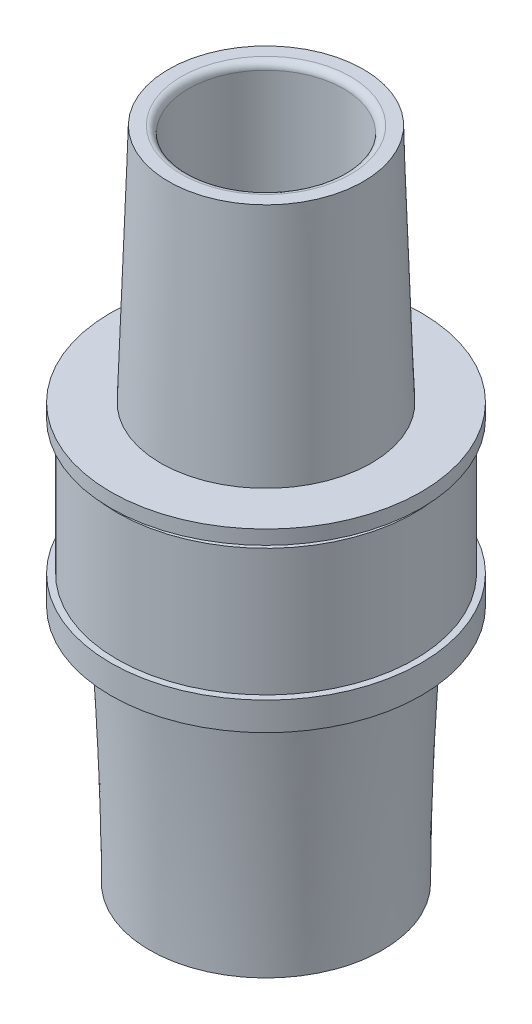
ISO-10303-21;
HEADER;
FILE_DESCRIPTION(('STEP AP214'),'2;1');
FILE_NAME('part.step','',(''),(''),'','','');
FILE_SCHEMA(('AUTOMOTIVE_DESIGN { 1 0 10303 214 1 1 1 1 }'));
ENDSEC;
DATA;
#1=APPLICATION_CONTEXT('core data for automotive mechanical design processes');
#2=APPLICATION_PROTOCOL_DEFINITION('international standard','automotive_design',2000,#1);
#3=PRODUCT_CONTEXT('',#1,'mechanical');
#4=PRODUCT('Part','Part','',(#3));
#5=PRODUCT_RELATED_PRODUCT_CATEGORY('part','',(#4));
#6=PRODUCT_DEFINITION_FORMATION('','',#4);
#7=PRODUCT_DEFINITION_CONTEXT('part definition',#1,'design');
#8=PRODUCT_DEFINITION('design','',#6,#7);
#9=PRODUCT_DEFINITION_SHAPE('','',#8);
#10=(LENGTH_UNIT() NAMED_UNIT(*) SI_UNIT(.MILLI.,.METRE.));
#11=(NAMED_UNIT(*) PLANE_ANGLE_UNIT() SI_UNIT($,.RADIAN.));
#12=(NAMED_UNIT(*) SI_UNIT($,.STERADIAN.) SOLID_ANGLE_UNIT());
#13=UNCERTAINTY_MEASURE_WITH_UNIT(LENGTH_MEASURE(1.E-05),#10,'distance_accuracy_value','');
#14=(GEOMETRIC_REPRESENTATION_CONTEXT(3) GLOBAL_UNCERTAINTY_ASSIGNED_CONTEXT((#13)) GLOBAL_UNIT_ASSIGNED_CONTEXT((#10,
#11,#12)) REPRESENTATION_CONTEXT('',''));
#15=CARTESIAN_POINT('',(0.,0.,0.));
#16=DIRECTION('',(0.,0.,1.));
#17=DIRECTION('',(1.,0.,0.));
#18=AXIS2_PLACEMENT_3D('',#15,#16,#17);
#19=CARTESIAN_POINT('',(0.,-37.,0.));
#20=DIRECTION('',(0.,1.,0.));
#21=DIRECTION('',(0.,0.,1.));
#22=AXIS2_PLACEMENT_3D('',#19,#20,#21);
#23=PLANE('',#22);
#24=CARTESIAN_POINT('',(0.,-37.,0.));
#25=DIRECTION('',(0.,1.,0.));
#26=DIRECTION('',(0.,0.,1.));
#27=AXIS2_PLACEMENT_3D('',#24,#25,#26);
#28=CIRCLE('',#27,8.25);
#29=CARTESIAN_POINT('',(-8.23983871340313,-37.,0.409338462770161));
#30=VERTEX_POINT('',#29);
#31=EDGE_CURVE('E65',#30,#30,#28,.T.);
#32=ORIENTED_EDGE('',*,*,#31,.F.);
#33=EDGE_LOOP('',(#32));
#34=FACE_BOUND('',#33,.T.);
#35=DIRECTION('',(0.382683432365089,0.,0.923879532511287));
#36=VECTOR('',#35,1.);
#37=CARTESIAN_POINT('',(-3.75029763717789,-37.,3.75029763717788));
#38=LINE('',#37,#36);
#39=CARTESIAN_POINT('',(-5.30372178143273,-37.,0.));
#40=VERTEX_POINT('',#39);
#41=CARTESIAN_POINT('',(-3.75029763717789,-37.,3.75029763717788));
#42=VERTEX_POINT('',#41);
#43=EDGE_CURVE('E139',#40,#42,#38,.T.);
#44=ORIENTED_EDGE('',*,*,#43,.T.);
#45=DIRECTION('',(0.923879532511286,0.,0.382683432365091));
#46=VECTOR('',#45,1.);
#47=CARTESIAN_POINT('',(0.,-37.,5.30372178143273));
#48=LINE('',#47,#46);
#49=CARTESIAN_POINT('',(0.,-37.,5.30372178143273));
#50=VERTEX_POINT('',#49);
#51=EDGE_CURVE('E146',#42,#50,#48,.T.);
#52=ORIENTED_EDGE('',*,*,#51,.T.);
#53=DIRECTION('',(0.923879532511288,0.,-0.382683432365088));
#54=VECTOR('',#53,1.);
#55=CARTESIAN_POINT('',(3.75029763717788,-37.,3.75029763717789));
#56=LINE('',#55,#54);
#57=CARTESIAN_POINT('',(3.75029763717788,-37.,3.75029763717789));
#58=VERTEX_POINT('',#57);
#59=EDGE_CURVE('E148',#50,#58,#56,.T.);
#60=ORIENTED_EDGE('',*,*,#59,.T.);
#61=DIRECTION('',(0.382683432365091,0.,-0.923879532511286));
#62=VECTOR('',#61,1.);
#63=CARTESIAN_POINT('',(5.30372178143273,-37.,0.));
#64=LINE('',#63,#62);
#65=CARTESIAN_POINT('',(5.30372178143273,-37.,0.));
#66=VERTEX_POINT('',#65);
#67=EDGE_CURVE('E157',#58,#66,#64,.T.);
#68=ORIENTED_EDGE('',*,*,#67,.T.);
#69=DIRECTION('',(-0.382683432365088,0.,-0.923879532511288));
#70=VECTOR('',#69,1.);
#71=CARTESIAN_POINT('',(3.75029763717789,-37.,-3.75029763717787));
#72=LINE('',#71,#70);
#73=CARTESIAN_POINT('',(3.75029763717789,-37.,-3.75029763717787));
#74=VERTEX_POINT('',#73);
#75=EDGE_CURVE('E154',#66,#74,#72,.T.);
#76=ORIENTED_EDGE('',*,*,#75,.T.);
#77=DIRECTION('',(-0.923879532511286,0.,-0.382683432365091));
#78=VECTOR('',#77,1.);
#79=CARTESIAN_POINT('',(0.,-37.,-5.30372178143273));
#80=LINE('',#79,#78);
#81=CARTESIAN_POINT('',(0.,-37.,-5.30372178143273));
#82=VERTEX_POINT('',#81);
#83=EDGE_CURVE('E152',#74,#82,#80,.T.);
#84=ORIENTED_EDGE('',*,*,#83,.T.);
#85=DIRECTION('',(-0.923879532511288,0.,0.382683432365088));
#86=VECTOR('',#85,1.);
#87=CARTESIAN_POINT('',(-3.75029763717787,-37.,-3.75029763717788));
#88=LINE('',#87,#86);
#89=CARTESIAN_POINT('',(-3.75029763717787,-37.,-3.75029763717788));
#90=VERTEX_POINT('',#89);
#91=EDGE_CURVE('E142',#82,#90,#88,.T.);
#92=ORIENTED_EDGE('',*,*,#91,.T.);
#93=DIRECTION('',(-0.382683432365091,0.,0.923879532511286));
#94=VECTOR('',#93,1.);
#95=CARTESIAN_POINT('',(-5.30372178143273,-37.,0.));
#96=LINE('',#95,#94);
#97=EDGE_CURVE('E126',#90,#40,#96,.T.);
#98=ORIENTED_EDGE('',*,*,#97,.T.);
#99=EDGE_LOOP('',(#44,#52,#60,#68,#76,#84,#92,#98));
#100=FACE_BOUND('',#99,.T.);
#101=ADVANCED_FACE('F54',(#34,#100),#23,.F.);
#102=CARTESIAN_POINT('',(-8.23983871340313,-37.,0.409338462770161));
#103=CARTESIAN_POINT('',(-8.17687382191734,-20.,3.51407662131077));
#104=CARTESIAN_POINT('',(-7.42116178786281,-37.,16.8890158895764));
#105=CARTESIAN_POINT('',(-1.1487205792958,-20.,19.8678242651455));
#106=CARTESIAN_POINT('',(9.05851563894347,-37.,16.0703389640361));
#107=CARTESIAN_POINT('',(15.2050270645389,-20.,12.8396710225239));
#108=CARTESIAN_POINT('',(8.23983871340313,-37.,-0.40933846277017));
#109=CARTESIAN_POINT('',(8.17687382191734,-20.,-3.51407662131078));
#110=CARTESIAN_POINT('',(7.42116178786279,-37.,-16.8890158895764));
#111=CARTESIAN_POINT('',(1.14872057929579,-20.,-19.8678242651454));
#112=CARTESIAN_POINT('',(-9.05851563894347,-37.,-16.0703389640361));
#113=CARTESIAN_POINT('',(-15.2050270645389,-20.,-12.8396710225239));
#114=CARTESIAN_POINT('',(-8.23983871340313,-37.,0.409338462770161));
#115=CARTESIAN_POINT('',(-8.17687382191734,-20.,3.51407662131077));
#116=(BOUNDED_SURFACE() B_SPLINE_SURFACE(3,1,((#102,#103),(#104,#105),(#106,#107),(#108,#109),
(#110,#111),(#112,#113),(#114,#115)),.UNSPECIFIED.,.T.,.F.,.F.) B_SPLINE_SURFACE_WITH_KNOTS((4,
3,4),(2,2),(0.,0.5,1.),(0.,1.),
.UNSPECIFIED.) GEOMETRIC_REPRESENTATION_ITEM() RATIONAL_B_SPLINE_SURFACE(((1.,1.),
(0.333333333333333,0.333333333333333),(0.333333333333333,0.333333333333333),(1.,1.),
(0.333333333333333,0.333333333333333),(0.333333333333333,0.333333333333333),(1.,1.))) REPRESENTATION_ITEM('') SURFACE());
#117=CARTESIAN_POINT('',(0.,-20.,0.));
#118=DIRECTION('',(0.,1.,0.));
#119=DIRECTION('',(0.,0.,1.));
#120=AXIS2_PLACEMENT_3D('',#117,#118,#119);
#121=CIRCLE('',#120,8.9);
#122=CARTESIAN_POINT('',(-8.17687382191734,-20.,3.51407662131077));
#123=VERTEX_POINT('',#122);
#124=EDGE_CURVE('E14',#123,#123,#121,.T.);
#125=CARTESIAN_POINT('',(-8.23983871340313,-37.,0.409338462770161));
#126=CARTESIAN_POINT('',(-8.23918282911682,-36.8229166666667,0.44167948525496));
#127=CARTESIAN_POINT('',(-8.23852694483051,-36.6458333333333,0.474020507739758));
#128=CARTESIAN_POINT('',(-8.23721517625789,-36.2916666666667,0.538702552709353));
#129=CARTESIAN_POINT('',(-8.23655929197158,-36.1145833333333,0.571043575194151));
#130=CARTESIAN_POINT('',(-8.23524752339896,-35.7604166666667,0.635725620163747));
#131=CARTESIAN_POINT('',(-8.23459163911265,-35.5833333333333,0.668066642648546));
#132=CARTESIAN_POINT('',(-8.23327987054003,-35.2291666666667,0.732748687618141));
#133=CARTESIAN_POINT('',(-8.23262398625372,-35.0520833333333,0.765089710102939));
#134=CARTESIAN_POINT('',(-8.2313122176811,-34.6979166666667,0.829771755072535));
#135=CARTESIAN_POINT('',(-8.23065633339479,-34.5208333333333,0.862112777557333));
#136=CARTESIAN_POINT('',(-8.22934456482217,-34.1666666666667,0.926794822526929));
#137=CARTESIAN_POINT('',(-8.22868868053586,-33.9895833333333,0.959135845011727));
#138=CARTESIAN_POINT('',(-8.22737691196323,-33.6354166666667,1.02381788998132));
#139=CARTESIAN_POINT('',(-8.22672102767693,-33.4583333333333,1.05615891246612));
#140=CARTESIAN_POINT('',(-8.22540925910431,-33.1041666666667,1.12084095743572));
#141=CARTESIAN_POINT('',(-8.224753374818,-32.9270833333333,1.15318197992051));
#142=CARTESIAN_POINT('',(-8.22344160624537,-32.5729166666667,1.21786402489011));
#143=CARTESIAN_POINT('',(-8.22278572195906,-32.3958333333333,1.25020504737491));
#144=CARTESIAN_POINT('',(-8.22147395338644,-32.0416666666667,1.3148870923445));
#145=CARTESIAN_POINT('',(-8.22081806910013,-31.8645833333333,1.3472281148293));
#146=CARTESIAN_POINT('',(-8.21950630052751,-31.5104166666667,1.4119101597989));
#147=CARTESIAN_POINT('',(-8.2188504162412,-31.3333333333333,1.4442511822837));
#148=CARTESIAN_POINT('',(-8.21753864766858,-30.9791666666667,1.50893322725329));
#149=CARTESIAN_POINT('',(-8.21688276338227,-30.8020833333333,1.54127424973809));
#150=CARTESIAN_POINT('',(-8.21557099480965,-30.4479166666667,1.60595629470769));
#151=CARTESIAN_POINT('',(-8.21491511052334,-30.2708333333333,1.63829731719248));
#152=CARTESIAN_POINT('',(-8.21360334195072,-29.9166666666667,1.70297936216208));
#153=CARTESIAN_POINT('',(-8.21294745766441,-29.7395833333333,1.73532038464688));
#154=CARTESIAN_POINT('',(-8.21163568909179,-29.3854166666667,1.80000242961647));
#155=CARTESIAN_POINT('',(-8.21097980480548,-29.2083333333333,1.83234345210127));
#156=CARTESIAN_POINT('',(-8.20966803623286,-28.8541666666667,1.89702549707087));
#157=CARTESIAN_POINT('',(-8.20901215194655,-28.6770833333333,1.92936651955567));
#158=CARTESIAN_POINT('',(-8.20770038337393,-28.3229166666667,1.99404856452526));
#159=CARTESIAN_POINT('',(-8.20704449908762,-28.1458333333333,2.02638958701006));
#160=CARTESIAN_POINT('',(-8.20573273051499,-27.7916666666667,2.09107163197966));
#161=CARTESIAN_POINT('',(-8.20507684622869,-27.6145833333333,2.12341265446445));
#162=CARTESIAN_POINT('',(-8.20376507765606,-27.2604166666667,2.18809469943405));
#163=CARTESIAN_POINT('',(-8.20310919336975,-27.0833333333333,2.22043572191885));
#164=CARTESIAN_POINT('',(-8.20179742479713,-26.7291666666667,2.28511776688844));
#165=CARTESIAN_POINT('',(-8.20114154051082,-26.5520833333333,2.31745878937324));
#166=CARTESIAN_POINT('',(-8.1998297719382,-26.1979166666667,2.38214083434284));
#167=CARTESIAN_POINT('',(-8.19917388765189,-26.0208333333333,2.41448185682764));
#168=CARTESIAN_POINT('',(-8.19786211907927,-25.6666666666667,2.47916390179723));
#169=CARTESIAN_POINT('',(-8.19720623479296,-25.4895833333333,2.51150492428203));
#170=CARTESIAN_POINT('',(-8.19589446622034,-25.1354166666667,2.57618696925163));
#171=CARTESIAN_POINT('',(-8.19523858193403,-24.9583333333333,2.60852799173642));
#172=CARTESIAN_POINT('',(-8.19392681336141,-24.6041666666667,2.67321003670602));
#173=CARTESIAN_POINT('',(-8.1932709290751,-24.4270833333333,2.70555105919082));
#174=CARTESIAN_POINT('',(-8.19195916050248,-24.0729166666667,2.77023310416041));
#175=CARTESIAN_POINT('',(-8.19130327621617,-23.8958333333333,2.80257412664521));
#176=CARTESIAN_POINT('',(-8.18999150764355,-23.5416666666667,2.86725617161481));
#177=CARTESIAN_POINT('',(-8.18933562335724,-23.3645833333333,2.89959719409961));
#178=CARTESIAN_POINT('',(-8.18802385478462,-23.0104166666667,2.9642792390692));
#179=CARTESIAN_POINT('',(-8.18736797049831,-22.8333333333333,2.996620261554));
#180=CARTESIAN_POINT('',(-8.18605620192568,-22.4791666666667,3.0613023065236));
#181=CARTESIAN_POINT('',(-8.18540031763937,-22.3020833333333,3.09364332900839));
#182=CARTESIAN_POINT('',(-8.18408854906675,-21.9479166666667,3.15832537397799));
#183=CARTESIAN_POINT('',(-8.18343266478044,-21.7708333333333,3.19066639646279));
#184=CARTESIAN_POINT('',(-8.18212089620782,-21.4166666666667,3.25534844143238));
#185=CARTESIAN_POINT('',(-8.18146501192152,-21.2395833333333,3.28768946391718));
#186=CARTESIAN_POINT('',(-8.18015324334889,-20.8854166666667,3.35237150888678));
#187=CARTESIAN_POINT('',(-8.17949735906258,-20.7083333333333,3.38471253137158));
#188=CARTESIAN_POINT('',(-8.17818559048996,-20.3541666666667,3.44939457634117));
#189=CARTESIAN_POINT('',(-8.17752970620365,-20.1770833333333,3.48173559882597));
#190=CARTESIAN_POINT('',(-8.17687382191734,-20.,3.51407662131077));
#191=B_SPLINE_CURVE_WITH_KNOTS('',3,(#125,#126,#127,#128,#129,#130,#131,#132,#133,#134,#135,
#136,#137,#138,#139,#140,#141,#142,#143,#144,#145,#146,#147,#148,#149,#150,#151,#152,#153,#154,
#155,#156,#157,#158,#159,#160,#161,#162,#163,#164,#165,#166,#167,#168,#169,#170,#171,#172,#173,
#174,#175,#176,#177,#178,#179,#180,#181,#182,#183,#184,#185,#186,#187,#188,#189,#190),
.UNSPECIFIED.,.F.,.F.,(4,2,2,2,2,2,2,2,2,2,2,2,2,2,2,2,2,2,2,2,2,2,2,2,2,2,2,2,2,2,2,2,4),(0.,
0.54004065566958,1.08008131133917,1.62012196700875,2.16016262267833,2.70020327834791,
3.24024393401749,3.78028458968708,4.32032524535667,4.86036590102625,5.40040655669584,
5.94044721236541,6.480487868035,7.02052852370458,7.56056917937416,8.10060983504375,
8.64065049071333,9.18069114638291,9.7207318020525,10.2607724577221,10.8008131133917,
11.3408537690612,11.8808944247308,12.4209350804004,12.96097573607,13.5010163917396,
14.0410570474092,14.5810977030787,15.1211383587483,15.6611790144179,16.2012196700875,
16.7412603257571,17.2813009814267),.UNSPECIFIED.);
#192=EDGE_CURVE('BSEAM56',#30,#123,#191,.T.);
#193=ORIENTED_EDGE('',*,*,#31,.T.);
#194=ORIENTED_EDGE('',*,*,#124,.F.);
#195=ORIENTED_EDGE('',*,*,#192,.T.);
#196=ORIENTED_EDGE('',*,*,#192,.F.);
#197=EDGE_LOOP('',(#193,#195,#194,#196));
#198=FACE_BOUND('',#197,.T.);
#199=ADVANCED_FACE('F56',(#198),#116,.T.);
#200=CARTESIAN_POINT('',(0.,-19.,-11.));
#201=DIRECTION('',(0.,-1.,0.));
#202=DIRECTION('',(0.,0.,-1.));
#203=AXIS2_PLACEMENT_3D('',#200,#201,#202);
#204=PLANE('',#203);
#205=CARTESIAN_POINT('',(0.,-19.,0.));
#206=DIRECTION('',(0.,1.,0.));
#207=DIRECTION('',(0.,0.,1.));
#208=AXIS2_PLACEMENT_3D('',#205,#206,#207);
#209=CIRCLE('',#208,4.);
#210=CARTESIAN_POINT('',(0.,-19.,4.));
#211=VERTEX_POINT('',#210);
#212=EDGE_CURVE('E213',#211,#211,#209,.T.);
#213=ORIENTED_EDGE('',*,*,#212,.T.);
#214=EDGE_LOOP('',(#213));
#215=FACE_BOUND('',#214,.T.);
#216=DIRECTION('',(-0.923879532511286,0.,-0.382683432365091));
#217=VECTOR('',#216,1.);
#218=CARTESIAN_POINT('',(0.,-19.,5.30372178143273));
#219=LINE('',#218,#217);
#220=CARTESIAN_POINT('',(0.,-19.,5.30372178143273));
#221=VERTEX_POINT('',#220);
#222=CARTESIAN_POINT('',(-3.75029763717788,-19.,3.75029763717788));
#223=VERTEX_POINT('',#222);
#224=EDGE_CURVE('E179',#221,#223,#219,.T.);
#225=ORIENTED_EDGE('',*,*,#224,.T.);
#226=DIRECTION('',(-0.382683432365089,0.,-0.923879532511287));
#227=VECTOR('',#226,1.);
#228=CARTESIAN_POINT('',(-3.75029763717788,-19.,3.75029763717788));
#229=LINE('',#228,#227);
#230=CARTESIAN_POINT('',(-5.30372178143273,-19.,0.));
#231=VERTEX_POINT('',#230);
#232=EDGE_CURVE('E143',#223,#231,#229,.T.);
#233=ORIENTED_EDGE('',*,*,#232,.T.);
#234=DIRECTION('',(0.382683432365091,0.,-0.923879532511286));
#235=VECTOR('',#234,1.);
#236=CARTESIAN_POINT('',(-5.30372178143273,-19.,0.));
#237=LINE('',#236,#235);
#238=CARTESIAN_POINT('',(-3.75029763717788,-19.,-3.75029763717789));
#239=VERTEX_POINT('',#238);
#240=EDGE_CURVE('E128',#231,#239,#237,.T.);
#241=ORIENTED_EDGE('',*,*,#240,.T.);
#242=DIRECTION('',(0.923879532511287,0.,-0.382683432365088));
#243=VECTOR('',#242,1.);
#244=CARTESIAN_POINT('',(-3.75029763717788,-19.,-3.75029763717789));
#245=LINE('',#244,#243);
#246=CARTESIAN_POINT('',(0.,-19.,-5.30372178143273));
#247=VERTEX_POINT('',#246);
#248=EDGE_CURVE('E164',#239,#247,#245,.T.);
#249=ORIENTED_EDGE('',*,*,#248,.T.);
#250=DIRECTION('',(0.923879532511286,0.,0.382683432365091));
#251=VECTOR('',#250,1.);
#252=CARTESIAN_POINT('',(0.,-19.,-5.30372178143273));
#253=LINE('',#252,#251);
#254=CARTESIAN_POINT('',(3.75029763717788,-19.,-3.75029763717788));
#255=VERTEX_POINT('',#254);
#256=EDGE_CURVE('E167',#247,#255,#253,.T.);
#257=ORIENTED_EDGE('',*,*,#256,.T.);
#258=DIRECTION('',(0.382683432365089,0.,0.923879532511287));
#259=VECTOR('',#258,1.);
#260=CARTESIAN_POINT('',(3.75029763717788,-19.,-3.75029763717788));
#261=LINE('',#260,#259);
#262=CARTESIAN_POINT('',(5.30372178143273,-19.,0.));
#263=VERTEX_POINT('',#262);
#264=EDGE_CURVE('E170',#255,#263,#261,.T.);
#265=ORIENTED_EDGE('',*,*,#264,.T.);
#266=DIRECTION('',(-0.382683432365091,0.,0.923879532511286));
#267=VECTOR('',#266,1.);
#268=CARTESIAN_POINT('',(5.30372178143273,-19.,0.));
#269=LINE('',#268,#267);
#270=CARTESIAN_POINT('',(3.75029763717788,-19.,3.75029763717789));
#271=VERTEX_POINT('',#270);
#272=EDGE_CURVE('E173',#263,#271,#269,.T.);
#273=ORIENTED_EDGE('',*,*,#272,.T.);
#274=DIRECTION('',(-0.923879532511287,0.,0.382683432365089));
#275=VECTOR('',#274,1.);
#276=CARTESIAN_POINT('',(3.75029763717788,-19.,3.75029763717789));
#277=LINE('',#276,#275);
#278=EDGE_CURVE('E176',#271,#221,#277,.T.);
#279=ORIENTED_EDGE('',*,*,#278,.T.);
#280=EDGE_LOOP('',(#225,#233,#241,#249,#257,#265,#273,#279));
#281=FACE_BOUND('',#280,.T.);
#282=ADVANCED_FACE('F244',(#215,#281),#204,.T.);
#283=CARTESIAN_POINT('',(0.,-9.,0.));
#284=DIRECTION('',(0.,1.,0.));
#285=DIRECTION('',(0.,0.,1.));
#286=AXIS2_PLACEMENT_3D('',#283,#284,#285);
#287=PLANE('',#286);
#288=CARTESIAN_POINT('',(0.,-9.,0.));
#289=DIRECTION('',(0.,1.,0.));
#290=DIRECTION('',(0.,0.,1.));
#291=AXIS2_PLACEMENT_3D('',#288,#289,#290);
#292=CIRCLE('',#291,8.8);
#293=CARTESIAN_POINT('',(0.,-9.,8.8));
#294=VERTEX_POINT('',#293);
#295=EDGE_CURVE('E195',#294,#294,#292,.F.);
#296=ORIENTED_EDGE('',*,*,#295,.T.);
#297=EDGE_LOOP('',(#296));
#298=FACE_BOUND('',#297,.T.);
#299=CARTESIAN_POINT('',(0.,-9.,0.));
#300=DIRECTION('',(0.,1.,0.));
#301=DIRECTION('',(0.,0.,1.));
#302=AXIS2_PLACEMENT_3D('',#299,#300,#301);
#303=CIRCLE('',#302,10.55);
#304=CARTESIAN_POINT('',(0.,-9.,10.55));
#305=VERTEX_POINT('',#304);
#306=EDGE_CURVE('E207',#305,#305,#303,.T.);
#307=ORIENTED_EDGE('',*,*,#306,.T.);
#308=EDGE_LOOP('',(#307));
#309=FACE_BOUND('',#308,.T.);
#310=ADVANCED_FACE('F247',(#298,#309),#287,.T.);
#311=CARTESIAN_POINT('',(0.,-9.,0.));
#312=DIRECTION('',(0.,-1.,0.));
#313=DIRECTION('',(0.,0.,-1.));
#314=AXIS2_PLACEMENT_3D('',#311,#312,#313);
#315=CYLINDRICAL_SURFACE('',#314,10.55);
#316=ORIENTED_EDGE('',*,*,#306,.F.);
#317=EDGE_LOOP('',(#316));
#318=FACE_BOUND('',#317,.T.);
#319=CARTESIAN_POINT('',(0.,-18.,0.));
#320=DIRECTION('',(0.,-1.,0.));
#321=DIRECTION('',(0.,0.,-1.));
#322=AXIS2_PLACEMENT_3D('',#319,#320,#321);
#323=CIRCLE('',#322,10.55);
#324=CARTESIAN_POINT('',(0.,-18.,-10.55));
#325=VERTEX_POINT('',#324);
#326=EDGE_CURVE('E201',#325,#325,#323,.F.);
#327=ORIENTED_EDGE('',*,*,#326,.T.);
#328=EDGE_LOOP('',(#327));
#329=FACE_BOUND('',#328,.T.);
#330=ADVANCED_FACE('F262',(#318,#329),#315,.T.);
#331=CARTESIAN_POINT('',(-8.,-18.,0.));
#332=DIRECTION('',(0.,-1.,0.));
#333=DIRECTION('',(0.,0.,1.));
#334=AXIS2_PLACEMENT_3D('',#331,#332,#333);
#335=PLANE('',#334);
#336=ORIENTED_EDGE('',*,*,#326,.F.);
#337=EDGE_LOOP('',(#336));
#338=FACE_BOUND('',#337,.T.);
#339=CARTESIAN_POINT('',(0.,-18.,0.));
#340=DIRECTION('',(0.,-1.,0.));
#341=DIRECTION('',(0.,0.,-1.));
#342=AXIS2_PLACEMENT_3D('',#339,#340,#341);
#343=CIRCLE('',#342,11.);
#344=CARTESIAN_POINT('',(0.,-18.,-11.));
#345=VERTEX_POINT('',#344);
#346=EDGE_CURVE('E204',#345,#345,#343,.T.);
#347=ORIENTED_EDGE('',*,*,#346,.F.);
#348=EDGE_LOOP('',(#347));
#349=FACE_BOUND('',#348,.T.);
#350=ADVANCED_FACE('F266',(#338,#349),#335,.F.);
#351=CARTESIAN_POINT('',(0.,-18.,0.));
#352=DIRECTION('',(0.,1.,0.));
#353=DIRECTION('',(0.,0.,-1.));
#354=AXIS2_PLACEMENT_3D('',#351,#352,#353);
#355=CYLINDRICAL_SURFACE('',#354,11.);
#356=ORIENTED_EDGE('',*,*,#346,.T.);
#357=EDGE_LOOP('',(#356));
#358=FACE_BOUND('',#357,.T.);
#359=CARTESIAN_POINT('',(0.,-20.,0.));
#360=DIRECTION('',(0.,-1.,0.));
#361=DIRECTION('',(0.,0.,-1.));
#362=AXIS2_PLACEMENT_3D('',#359,#360,#361);
#363=CIRCLE('',#362,11.);
#364=CARTESIAN_POINT('',(0.,-20.,-11.));
#365=VERTEX_POINT('',#364);
#366=EDGE_CURVE('E132',#365,#365,#363,.T.);
#367=ORIENTED_EDGE('',*,*,#366,.F.);
#368=EDGE_LOOP('',(#367));
#369=FACE_BOUND('',#368,.T.);
#370=ADVANCED_FACE('F270',(#358,#369),#355,.T.);
#371=CARTESIAN_POINT('',(0.,-9.86602540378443,0.));
#372=DIRECTION('',(0.,1.,0.));
#373=DIRECTION('',(0.,0.,1.));
#374=AXIS2_PLACEMENT_3D('',#371,#372,#373);
#375=CONICAL_SURFACE('',#374,8.3,0.5235987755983);
#376=ORIENTED_EDGE('',*,*,#295,.F.);
#377=EDGE_LOOP('',(#376));
#378=FACE_BOUND('',#377,.T.);
#379=CARTESIAN_POINT('',(0.,-9.86602540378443,0.));
#380=DIRECTION('',(0.,1.,0.));
#381=DIRECTION('',(0.,0.,1.));
#382=AXIS2_PLACEMENT_3D('',#379,#380,#381);
#383=CIRCLE('',#382,8.3);
#384=CARTESIAN_POINT('',(0.,-9.86602540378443,8.3));
#385=VERTEX_POINT('',#384);
#386=EDGE_CURVE('E198',#385,#385,#383,.T.);
#387=ORIENTED_EDGE('',*,*,#386,.F.);
#388=EDGE_LOOP('',(#387));
#389=FACE_BOUND('',#388,.T.);
#390=ADVANCED_FACE('F258',(#378,#389),#375,.F.);
#391=CARTESIAN_POINT('',(0.,-9.,0.));
#392=DIRECTION('',(0.,-1.,0.));
#393=DIRECTION('',(0.,0.,-1.));
#394=AXIS2_PLACEMENT_3D('',#391,#392,#393);
#395=CYLINDRICAL_SURFACE('',#394,8.3);
#396=ORIENTED_EDGE('',*,*,#386,.T.);
#397=EDGE_LOOP('',(#396));
#398=FACE_BOUND('',#397,.T.);
#399=CARTESIAN_POINT('',(0.,-18.,0.));
#400=DIRECTION('',(0.,1.,0.));
#401=DIRECTION('',(0.,0.,1.));
#402=AXIS2_PLACEMENT_3D('',#399,#400,#401);
#403=CIRCLE('',#402,8.3);
#404=CARTESIAN_POINT('',(0.,-18.,8.3));
#405=VERTEX_POINT('',#404);
#406=EDGE_CURVE('E210',#405,#405,#403,.T.);
#407=ORIENTED_EDGE('',*,*,#406,.F.);
#408=EDGE_LOOP('',(#407));
#409=FACE_BOUND('',#408,.T.);
#410=ADVANCED_FACE('F255',(#398,#409),#395,.F.);
#411=ORIENTED_EDGE('',*,*,#406,.T.);
#412=EDGE_LOOP('',(#411));
#413=FACE_BOUND('',#412,.T.);
#414=CARTESIAN_POINT('',(0.,-18.,0.));
#415=DIRECTION('',(0.,1.,0.));
#416=DIRECTION('',(0.,0.,1.));
#417=AXIS2_PLACEMENT_3D('',#414,#415,#416);
#418=CIRCLE('',#417,4.);
#419=CARTESIAN_POINT('',(0.,-18.,4.));
#420=VERTEX_POINT('',#419);
#421=EDGE_CURVE('E214',#420,#420,#418,.T.);
#422=ORIENTED_EDGE('',*,*,#421,.F.);
#423=EDGE_LOOP('',(#422));
#424=FACE_BOUND('',#423,.T.);
#425=ADVANCED_FACE('F253',(#413,#424),#335,.F.);
#426=CARTESIAN_POINT('',(0.,-19.,0.));
#427=DIRECTION('',(0.,1.,0.));
#428=DIRECTION('',(0.,0.,1.));
#429=AXIS2_PLACEMENT_3D('',#426,#427,#428);
#430=CYLINDRICAL_SURFACE('',#429,4.);
#431=ORIENTED_EDGE('',*,*,#212,.F.);
#432=EDGE_LOOP('',(#431));
#433=FACE_BOUND('',#432,.T.);
#434=ORIENTED_EDGE('',*,*,#421,.T.);
#435=EDGE_LOOP('',(#434));
#436=FACE_BOUND('',#435,.T.);
#437=ADVANCED_FACE('F249',(#433,#436),#430,.F.);
#438=CARTESIAN_POINT('',(0.,-20.,0.));
#439=DIRECTION('',(0.,-1.,0.));
#440=DIRECTION('',(0.,0.,-1.));
#441=AXIS2_PLACEMENT_3D('',#438,#439,#440);
#442=PLANE('',#441);
#443=ORIENTED_EDGE('',*,*,#124,.T.);
#444=EDGE_LOOP('',(#443));
#445=FACE_BOUND('',#444,.T.);
#446=ORIENTED_EDGE('',*,*,#366,.T.);
#447=EDGE_LOOP('',(#446));
#448=FACE_BOUND('',#447,.T.);
#449=ADVANCED_FACE('F252',(#445,#448),#442,.T.);
#450=CARTESIAN_POINT('',(-3.75029763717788,-20.,3.75029763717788));
#451=DIRECTION('',(0.923879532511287,0.,-0.382683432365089));
#452=DIRECTION('',(-0.382683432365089,0.,-0.923879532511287));
#453=AXIS2_PLACEMENT_3D('',#450,#451,#452);
#454=PLANE('',#453);
#455=ORIENTED_EDGE('',*,*,#232,.F.);
#456=DIRECTION('',(0.,1.,0.));
#457=VECTOR('',#456,1.);
#458=CARTESIAN_POINT('',(-3.75029763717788,-20.,3.75029763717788));
#459=LINE('',#458,#457);
#460=EDGE_CURVE('E72',#42,#223,#459,.T.);
#461=ORIENTED_EDGE('',*,*,#460,.F.);
#462=ORIENTED_EDGE('',*,*,#43,.F.);
#463=DIRECTION('',(0.,1.,0.));
#464=VECTOR('',#463,1.);
#465=CARTESIAN_POINT('',(-5.30372178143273,-20.,0.));
#466=LINE('',#465,#464);
#467=EDGE_CURVE('E123',#40,#231,#466,.T.);
#468=ORIENTED_EDGE('',*,*,#467,.T.);
#469=EDGE_LOOP('',(#455,#461,#462,#468));
#470=FACE_BOUND('',#469,.T.);
#471=ADVANCED_FACE('F145',(#470),#454,.T.);
#472=CARTESIAN_POINT('',(-5.30372178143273,-20.,0.));
#473=DIRECTION('',(0.923879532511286,0.,0.382683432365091));
#474=DIRECTION('',(0.382683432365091,0.,-0.923879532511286));
#475=AXIS2_PLACEMENT_3D('',#472,#473,#474);
#476=PLANE('',#475);
#477=ORIENTED_EDGE('',*,*,#240,.F.);
#478=ORIENTED_EDGE('',*,*,#467,.F.);
#479=ORIENTED_EDGE('',*,*,#97,.F.);
#480=DIRECTION('',(0.,1.,0.));
#481=VECTOR('',#480,1.);
#482=CARTESIAN_POINT('',(-3.75029763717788,-20.,-3.75029763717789));
#483=LINE('',#482,#481);
#484=EDGE_CURVE('E133',#90,#239,#483,.T.);
#485=ORIENTED_EDGE('',*,*,#484,.T.);
#486=EDGE_LOOP('',(#477,#478,#479,#485));
#487=FACE_BOUND('',#486,.T.);
#488=ADVANCED_FACE('F125',(#487),#476,.T.);
#489=CARTESIAN_POINT('',(-3.75029763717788,-20.,-3.75029763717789));
#490=DIRECTION('',(0.382683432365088,0.,0.923879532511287));
#491=DIRECTION('',(0.923879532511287,0.,-0.382683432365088));
#492=AXIS2_PLACEMENT_3D('',#489,#490,#491);
#493=PLANE('',#492);
#494=ORIENTED_EDGE('',*,*,#248,.F.);
#495=ORIENTED_EDGE('',*,*,#484,.F.);
#496=ORIENTED_EDGE('',*,*,#91,.F.);
#497=DIRECTION('',(0.,1.,0.));
#498=VECTOR('',#497,1.);
#499=CARTESIAN_POINT('',(0.,-20.,-5.30372178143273));
#500=LINE('',#499,#498);
#501=EDGE_CURVE('E190',#82,#247,#500,.T.);
#502=ORIENTED_EDGE('',*,*,#501,.T.);
#503=EDGE_LOOP('',(#494,#495,#496,#502));
#504=FACE_BOUND('',#503,.T.);
#505=ADVANCED_FACE('F288',(#504),#493,.T.);
#506=CARTESIAN_POINT('',(0.,-20.,-5.30372178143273));
#507=DIRECTION('',(-0.382683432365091,0.,0.923879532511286));
#508=DIRECTION('',(0.923879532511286,0.,0.382683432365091));
#509=AXIS2_PLACEMENT_3D('',#506,#507,#508);
#510=PLANE('',#509);
#511=ORIENTED_EDGE('',*,*,#256,.F.);
#512=ORIENTED_EDGE('',*,*,#501,.F.);
#513=ORIENTED_EDGE('',*,*,#83,.F.);
#514=DIRECTION('',(0.,1.,0.));
#515=VECTOR('',#514,1.);
#516=CARTESIAN_POINT('',(3.75029763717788,-20.,-3.75029763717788));
#517=LINE('',#516,#515);
#518=EDGE_CURVE('E188',#74,#255,#517,.T.);
#519=ORIENTED_EDGE('',*,*,#518,.T.);
#520=EDGE_LOOP('',(#511,#512,#513,#519));
#521=FACE_BOUND('',#520,.T.);
#522=ADVANCED_FACE('F291',(#521),#510,.T.);
#523=CARTESIAN_POINT('',(3.75029763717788,-20.,-3.75029763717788));
#524=DIRECTION('',(-0.923879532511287,0.,0.382683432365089));
#525=DIRECTION('',(0.382683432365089,0.,0.923879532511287));
#526=AXIS2_PLACEMENT_3D('',#523,#524,#525);
#527=PLANE('',#526);
#528=ORIENTED_EDGE('',*,*,#264,.F.);
#529=ORIENTED_EDGE('',*,*,#518,.F.);
#530=ORIENTED_EDGE('',*,*,#75,.F.);
#531=DIRECTION('',(0.,1.,0.));
#532=VECTOR('',#531,1.);
#533=CARTESIAN_POINT('',(5.30372178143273,-20.,0.));
#534=LINE('',#533,#532);
#535=EDGE_CURVE('E186',#66,#263,#534,.T.);
#536=ORIENTED_EDGE('',*,*,#535,.T.);
#537=EDGE_LOOP('',(#528,#529,#530,#536));
#538=FACE_BOUND('',#537,.T.);
#539=ADVANCED_FACE('F295',(#538),#527,.T.);
#540=CARTESIAN_POINT('',(5.30372178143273,-20.,0.));
#541=DIRECTION('',(-0.923879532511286,0.,-0.382683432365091));
#542=DIRECTION('',(-0.382683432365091,0.,0.923879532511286));
#543=AXIS2_PLACEMENT_3D('',#540,#541,#542);
#544=PLANE('',#543);
#545=ORIENTED_EDGE('',*,*,#272,.F.);
#546=ORIENTED_EDGE('',*,*,#535,.F.);
#547=ORIENTED_EDGE('',*,*,#67,.F.);
#548=DIRECTION('',(0.,1.,0.));
#549=VECTOR('',#548,1.);
#550=CARTESIAN_POINT('',(3.75029763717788,-20.,3.75029763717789));
#551=LINE('',#550,#549);
#552=EDGE_CURVE('E184',#58,#271,#551,.T.);
#553=ORIENTED_EDGE('',*,*,#552,.T.);
#554=EDGE_LOOP('',(#545,#546,#547,#553));
#555=FACE_BOUND('',#554,.T.);
#556=ADVANCED_FACE('F299',(#555),#544,.T.);
#557=CARTESIAN_POINT('',(3.75029763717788,-20.,3.75029763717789));
#558=DIRECTION('',(-0.382683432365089,0.,-0.923879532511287));
#559=DIRECTION('',(-0.923879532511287,0.,0.382683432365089));
#560=AXIS2_PLACEMENT_3D('',#557,#558,#559);
#561=PLANE('',#560);
#562=ORIENTED_EDGE('',*,*,#278,.F.);
#563=ORIENTED_EDGE('',*,*,#552,.F.);
#564=ORIENTED_EDGE('',*,*,#59,.F.);
#565=DIRECTION('',(0.,1.,0.));
#566=VECTOR('',#565,1.);
#567=CARTESIAN_POINT('',(0.,-20.,5.30372178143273));
#568=LINE('',#567,#566);
#569=EDGE_CURVE('E80',#50,#221,#568,.T.);
#570=ORIENTED_EDGE('',*,*,#569,.T.);
#571=EDGE_LOOP('',(#562,#563,#564,#570));
#572=FACE_BOUND('',#571,.T.);
#573=ADVANCED_FACE('F303',(#572),#561,.T.);
#574=CARTESIAN_POINT('',(0.,-20.,5.30372178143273));
#575=DIRECTION('',(0.382683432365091,0.,-0.923879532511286));
#576=DIRECTION('',(-0.923879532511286,0.,-0.382683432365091));
#577=AXIS2_PLACEMENT_3D('',#574,#575,#576);
#578=PLANE('',#577);
#579=ORIENTED_EDGE('',*,*,#224,.F.);
#580=ORIENTED_EDGE('',*,*,#569,.F.);
#581=ORIENTED_EDGE('',*,*,#51,.F.);
#582=ORIENTED_EDGE('',*,*,#460,.T.);
#583=EDGE_LOOP('',(#579,#580,#581,#582));
#584=FACE_BOUND('',#583,.T.);
#585=ADVANCED_FACE('F307',(#584),#578,.T.);
#586=CLOSED_SHELL('',(#101,#199,#282,#310,#330,#350,#370,#390,#410,#425,#437,#449,#471,#488,
#505,#522,#539,#556,#573,#585));
#587=MANIFOLD_SOLID_BREP('B2_NOT_SHOWN',#586);
#588=CARTESIAN_POINT('',(0.,-8.5,0.));
#589=DIRECTION('',(0.,-1.,0.));
#590=DIRECTION('',(0.,0.,-1.));
#591=AXIS2_PLACEMENT_3D('',#588,#589,#590);
#592=CYLINDRICAL_SURFACE('',#591,8.);
#593=CARTESIAN_POINT('',(0.,-8.5,0.));
#594=DIRECTION('',(0.,-1.,0.));
#595=DIRECTION('',(0.,0.,-1.));
#596=AXIS2_PLACEMENT_3D('',#593,#594,#595);
#597=CIRCLE('',#596,8.);
#598=CARTESIAN_POINT('',(0.,-8.5,-8.));
#599=VERTEX_POINT('',#598);
#600=EDGE_CURVE('E567',#599,#599,#597,.T.);
#601=ORIENTED_EDGE('',*,*,#600,.T.);
#602=EDGE_LOOP('',(#601));
#603=FACE_BOUND('',#602,.T.);
#604=CARTESIAN_POINT('',(0.,-13.,0.));
#605=DIRECTION('',(0.,-1.,0.));
#606=DIRECTION('',(0.,0.,-1.));
#607=AXIS2_PLACEMENT_3D('',#604,#605,#606);
#608=CIRCLE('',#607,8.);
#609=CARTESIAN_POINT('',(0.,-13.,-8.));
#610=VERTEX_POINT('',#609);
#611=EDGE_CURVE('E589',#610,#610,#608,.T.);
#612=ORIENTED_EDGE('',*,*,#611,.F.);
#613=EDGE_LOOP('',(#612));
#614=FACE_BOUND('',#613,.T.);
#615=ADVANCED_FACE('F538',(#603,#614),#592,.T.);
#616=CARTESIAN_POINT('',(0.,9.5,0.));
#617=DIRECTION('',(0.,-1.,0.));
#618=DIRECTION('',(0.,0.,-1.));
#619=AXIS2_PLACEMENT_3D('',#616,#617,#618);
#620=CONICAL_SURFACE('',#619,6.9,0.0333209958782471);
#621=CARTESIAN_POINT('',(0.,-7.5,0.));
#622=DIRECTION('',(0.,-1.,0.));
#623=DIRECTION('',(0.,0.,-1.));
#624=AXIS2_PLACEMENT_3D('',#621,#622,#623);
#625=CIRCLE('',#624,7.46666666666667);
#626=CARTESIAN_POINT('',(0.,-7.5,-7.46666666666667));
#627=VERTEX_POINT('',#626);
#628=EDGE_CURVE('E558',#627,#627,#625,.T.);
#629=ORIENTED_EDGE('',*,*,#628,.F.);
#630=EDGE_LOOP('',(#629));
#631=FACE_BOUND('',#630,.T.);
#632=CARTESIAN_POINT('',(0.,9.5,0.));
#633=DIRECTION('',(0.,-1.,0.));
#634=DIRECTION('',(0.,0.,-1.));
#635=AXIS2_PLACEMENT_3D('',#632,#633,#634);
#636=CIRCLE('',#635,6.9);
#637=CARTESIAN_POINT('',(0.,9.5,-6.9));
#638=VERTEX_POINT('',#637);
#639=EDGE_CURVE('E585',#638,#638,#636,.T.);
#640=ORIENTED_EDGE('',*,*,#639,.T.);
#641=EDGE_LOOP('',(#640));
#642=FACE_BOUND('',#641,.T.);
#643=ADVANCED_FACE('F621',(#631,#642),#620,.T.);
#644=CARTESIAN_POINT('',(-11.,-7.5,0.));
#645=DIRECTION('',(0.,-1.,0.));
#646=DIRECTION('',(0.,0.,-1.));
#647=AXIS2_PLACEMENT_3D('',#644,#645,#646);
#648=PLANE('',#647);
#649=CARTESIAN_POINT('',(0.,-7.5,0.));
#650=DIRECTION('',(0.,-1.,0.));
#651=DIRECTION('',(0.,0.,-1.));
#652=AXIS2_PLACEMENT_3D('',#649,#650,#651);
#653=CIRCLE('',#652,11.);
#654=CARTESIAN_POINT('',(0.,-7.5,-11.));
#655=VERTEX_POINT('',#654);
#656=EDGE_CURVE('E561',#655,#655,#653,.T.);
#657=ORIENTED_EDGE('',*,*,#656,.F.);
#658=EDGE_LOOP('',(#657));
#659=FACE_BOUND('',#658,.T.);
#660=ORIENTED_EDGE('',*,*,#628,.T.);
#661=EDGE_LOOP('',(#660));
#662=FACE_BOUND('',#661,.T.);
#663=ADVANCED_FACE('F628',(#659,#662),#648,.F.);
#664=CARTESIAN_POINT('',(0.,-8.5,0.));
#665=DIRECTION('',(0.,-1.,0.));
#666=DIRECTION('',(0.,0.,-1.));
#667=AXIS2_PLACEMENT_3D('',#664,#665,#666);
#668=CYLINDRICAL_SURFACE('',#667,11.);
#669=CARTESIAN_POINT('',(0.,-8.5,0.));
#670=DIRECTION('',(0.,-1.,0.));
#671=DIRECTION('',(0.,0.,-1.));
#672=AXIS2_PLACEMENT_3D('',#669,#670,#671);
#673=CIRCLE('',#672,11.);
#674=CARTESIAN_POINT('',(0.,-8.5,-11.));
#675=VERTEX_POINT('',#674);
#676=EDGE_CURVE('E564',#675,#675,#673,.T.);
#677=ORIENTED_EDGE('',*,*,#676,.F.);
#678=EDGE_LOOP('',(#677));
#679=FACE_BOUND('',#678,.T.);
#680=ORIENTED_EDGE('',*,*,#656,.T.);
#681=EDGE_LOOP('',(#680));
#682=FACE_BOUND('',#681,.T.);
#683=ADVANCED_FACE('F644',(#679,#682),#668,.T.);
#684=CARTESIAN_POINT('',(-8.,-8.5,0.));
#685=DIRECTION('',(0.,1.,0.));
#686=DIRECTION('',(0.,0.,1.));
#687=AXIS2_PLACEMENT_3D('',#684,#685,#686);
#688=PLANE('',#687);
#689=ORIENTED_EDGE('',*,*,#600,.F.);
#690=EDGE_LOOP('',(#689));
#691=FACE_BOUND('',#690,.T.);
#692=ORIENTED_EDGE('',*,*,#676,.T.);
#693=EDGE_LOOP('',(#692));
#694=FACE_BOUND('',#693,.T.);
#695=ADVANCED_FACE('F636',(#691,#694),#688,.F.);
#696=CARTESIAN_POINT('',(0.,-15.25,0.));
#697=DIRECTION('',(0.,-1.,0.));
#698=DIRECTION('',(0.,0.,-1.));
#699=AXIS2_PLACEMENT_3D('',#696,#697,#698);
#700=CIRCLE('',#699,8.);
#701=CARTESIAN_POINT('',(0.,-15.25,-8.));
#702=VERTEX_POINT('',#701);
#703=EDGE_CURVE('E588',#702,#702,#700,.T.);
#704=ORIENTED_EDGE('',*,*,#703,.T.);
#705=EDGE_LOOP('',(#704));
#706=FACE_BOUND('',#705,.T.);
#707=CARTESIAN_POINT('',(0.,-17.2,0.));
#708=DIRECTION('',(0.,1.,0.));
#709=DIRECTION('',(0.,0.,1.));
#710=AXIS2_PLACEMENT_3D('',#707,#708,#709);
#711=CIRCLE('',#710,8.);
#712=CARTESIAN_POINT('',(0.,-17.2,8.));
#713=VERTEX_POINT('',#712);
#714=EDGE_CURVE('E549',#713,#713,#711,.T.);
#715=ORIENTED_EDGE('',*,*,#714,.T.);
#716=EDGE_LOOP('',(#715));
#717=FACE_BOUND('',#716,.T.);
#718=ADVANCED_FACE('F624',(#706,#717),#592,.T.);
#719=CARTESIAN_POINT('',(-5.5,-17.5,0.));
#720=DIRECTION('',(0.,1.,0.));
#721=DIRECTION('',(0.,0.,1.));
#722=AXIS2_PLACEMENT_3D('',#719,#720,#721);
#723=PLANE('',#722);
#724=CARTESIAN_POINT('',(0.,-17.5,0.));
#725=DIRECTION('',(0.,1.,0.));
#726=DIRECTION('',(0.,0.,1.));
#727=AXIS2_PLACEMENT_3D('',#724,#725,#726);
#728=CIRCLE('',#727,7.8601077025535);
#729=CARTESIAN_POINT('',(0.,-17.5,7.8601077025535));
#730=VERTEX_POINT('',#729);
#731=EDGE_CURVE('E553',#730,#730,#728,.F.);
#732=ORIENTED_EDGE('',*,*,#731,.T.);
#733=EDGE_LOOP('',(#732));
#734=FACE_BOUND('',#733,.T.);
#735=CARTESIAN_POINT('',(0.,-17.5,0.));
#736=DIRECTION('',(0.,-1.,0.));
#737=DIRECTION('',(0.,0.,-1.));
#738=AXIS2_PLACEMENT_3D('',#735,#736,#737);
#739=CIRCLE('',#738,5.5);
#740=CARTESIAN_POINT('',(0.,-17.5,-5.5));
#741=VERTEX_POINT('',#740);
#742=EDGE_CURVE('E570',#741,#741,#739,.T.);
#743=ORIENTED_EDGE('',*,*,#742,.F.);
#744=EDGE_LOOP('',(#743));
#745=FACE_BOUND('',#744,.T.);
#746=ADVANCED_FACE('F635',(#734,#745),#723,.F.);
#747=CARTESIAN_POINT('',(0.,-8.5,0.));
#748=DIRECTION('',(0.,-1.,0.));
#749=DIRECTION('',(0.,0.,-1.));
#750=AXIS2_PLACEMENT_3D('',#747,#748,#749);
#751=CYLINDRICAL_SURFACE('',#750,5.5);
#752=CARTESIAN_POINT('',(0.,-12.,0.));
#753=DIRECTION('',(0.,-1.,0.));
#754=DIRECTION('',(0.,0.,-1.));
#755=AXIS2_PLACEMENT_3D('',#752,#753,#754);
#756=CIRCLE('',#755,5.5);
#757=CARTESIAN_POINT('',(0.,-12.,-5.5));
#758=VERTEX_POINT('',#757);
#759=EDGE_CURVE('E573',#758,#758,#756,.T.);
#760=ORIENTED_EDGE('',*,*,#759,.F.);
#761=EDGE_LOOP('',(#760));
#762=FACE_BOUND('',#761,.T.);
#763=ORIENTED_EDGE('',*,*,#742,.T.);
#764=EDGE_LOOP('',(#763));
#765=FACE_BOUND('',#764,.T.);
#766=ADVANCED_FACE('F642',(#762,#765),#751,.F.);
#767=CARTESIAN_POINT('',(-4.,-12.,0.));
#768=DIRECTION('',(0.,1.,0.));
#769=DIRECTION('',(0.,0.,1.));
#770=AXIS2_PLACEMENT_3D('',#767,#768,#769);
#771=PLANE('',#770);
#772=CARTESIAN_POINT('',(0.,-12.,0.));
#773=DIRECTION('',(0.,-1.,0.));
#774=DIRECTION('',(0.,0.,-1.));
#775=AXIS2_PLACEMENT_3D('',#772,#773,#774);
#776=CIRCLE('',#775,4.);
#777=CARTESIAN_POINT('',(0.,-12.,-4.));
#778=VERTEX_POINT('',#777);
#779=EDGE_CURVE('E576',#778,#778,#776,.T.);
#780=ORIENTED_EDGE('',*,*,#779,.F.);
#781=EDGE_LOOP('',(#780));
#782=FACE_BOUND('',#781,.T.);
#783=ORIENTED_EDGE('',*,*,#759,.T.);
#784=EDGE_LOOP('',(#783));
#785=FACE_BOUND('',#784,.T.);
#786=ADVANCED_FACE('F658',(#782,#785),#771,.F.);
#787=CARTESIAN_POINT('',(0.,-8.5,0.));
#788=DIRECTION('',(0.,-1.,0.));
#789=DIRECTION('',(0.,0.,-1.));
#790=AXIS2_PLACEMENT_3D('',#787,#788,#789);
#791=CYLINDRICAL_SURFACE('',#790,4.);
#792=CARTESIAN_POINT('',(0.,-11.,0.));
#793=DIRECTION('',(0.,-1.,0.));
#794=DIRECTION('',(0.,0.,-1.));
#795=AXIS2_PLACEMENT_3D('',#792,#793,#794);
#796=CIRCLE('',#795,4.);
#797=CARTESIAN_POINT('',(0.,-11.,-4.));
#798=VERTEX_POINT('',#797);
#799=EDGE_CURVE('E579',#798,#798,#796,.T.);
#800=ORIENTED_EDGE('',*,*,#799,.F.);
#801=EDGE_LOOP('',(#800));
#802=FACE_BOUND('',#801,.T.);
#803=ORIENTED_EDGE('',*,*,#779,.T.);
#804=EDGE_LOOP('',(#803));
#805=FACE_BOUND('',#804,.T.);
#806=ADVANCED_FACE('F664',(#802,#805),#791,.F.);
#807=CARTESIAN_POINT('',(-5.5,-11.,0.));
#808=DIRECTION('',(0.,-1.,0.));
#809=DIRECTION('',(0.,0.,-1.));
#810=AXIS2_PLACEMENT_3D('',#807,#808,#809);
#811=PLANE('',#810);
#812=CARTESIAN_POINT('',(0.,-11.,0.));
#813=DIRECTION('',(0.,-1.,0.));
#814=DIRECTION('',(0.,0.,-1.));
#815=AXIS2_PLACEMENT_3D('',#812,#813,#814);
#816=CIRCLE('',#815,5.5);
#817=CARTESIAN_POINT('',(0.,-11.,-5.5));
#818=VERTEX_POINT('',#817);
#819=EDGE_CURVE('E582',#818,#818,#816,.T.);
#820=ORIENTED_EDGE('',*,*,#819,.F.);
#821=EDGE_LOOP('',(#820));
#822=FACE_BOUND('',#821,.T.);
#823=ORIENTED_EDGE('',*,*,#799,.T.);
#824=EDGE_LOOP('',(#823));
#825=FACE_BOUND('',#824,.T.);
#826=ADVANCED_FACE('F671',(#822,#825),#811,.F.);
#827=CARTESIAN_POINT('',(0.,-8.5,0.));
#828=DIRECTION('',(0.,-1.,0.));
#829=DIRECTION('',(0.,0.,-1.));
#830=AXIS2_PLACEMENT_3D('',#827,#828,#829);
#831=CYLINDRICAL_SURFACE('',#830,5.5);
#832=CARTESIAN_POINT('',(0.,9.,0.));
#833=DIRECTION('',(0.,-1.,0.));
#834=DIRECTION('',(0.,0.,-1.));
#835=AXIS2_PLACEMENT_3D('',#832,#833,#834);
#836=CIRCLE('',#835,5.5);
#837=CARTESIAN_POINT('',(0.,9.,-5.5));
#838=VERTEX_POINT('',#837);
#839=EDGE_CURVE('E53',#838,#838,#836,.F.);
#840=ORIENTED_EDGE('',*,*,#839,.T.);
#841=EDGE_LOOP('',(#840));
#842=FACE_BOUND('',#841,.T.);
#843=ORIENTED_EDGE('',*,*,#819,.T.);
#844=EDGE_LOOP('',(#843));
#845=FACE_BOUND('',#844,.T.);
#846=ADVANCED_FACE('F675',(#842,#845),#831,.F.);
#847=CARTESIAN_POINT('',(-5.5,9.5,0.));
#848=DIRECTION('',(0.,-1.,0.));
#849=DIRECTION('',(0.,0.,-1.));
#850=AXIS2_PLACEMENT_3D('',#847,#848,#849);
#851=PLANE('',#850);
#852=CARTESIAN_POINT('',(0.,9.5,0.));
#853=DIRECTION('',(0.,-1.,0.));
#854=DIRECTION('',(0.,0.,-1.));
#855=AXIS2_PLACEMENT_3D('',#852,#853,#854);
#856=CIRCLE('',#855,6.);
#857=CARTESIAN_POINT('',(0.,9.5,-6.));
#858=VERTEX_POINT('',#857);
#859=EDGE_CURVE('E545',#858,#858,#856,.T.);
#860=ORIENTED_EDGE('',*,*,#859,.T.);
#861=EDGE_LOOP('',(#860));
#862=FACE_BOUND('',#861,.T.);
#863=ORIENTED_EDGE('',*,*,#639,.F.);
#864=EDGE_LOOP('',(#863));
#865=FACE_BOUND('',#864,.T.);
#866=ADVANCED_FACE('F652',(#862,#865),#851,.F.);
#867=CARTESIAN_POINT('',(0.,-17.5,0.));
#868=DIRECTION('',(0.,1.,0.));
#869=DIRECTION('',(0.,0.,1.));
#870=AXIS2_PLACEMENT_3D('',#867,#868,#869);
#871=CONICAL_SURFACE('',#870,7.8601077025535,0.436332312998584);
#872=ORIENTED_EDGE('',*,*,#714,.F.);
#873=EDGE_LOOP('',(#872));
#874=FACE_BOUND('',#873,.T.);
#875=ORIENTED_EDGE('',*,*,#731,.F.);
#876=EDGE_LOOP('',(#875));
#877=FACE_BOUND('',#876,.T.);
#878=ADVANCED_FACE('F616',(#874,#877),#871,.T.);
#879=CARTESIAN_POINT('',(0.,-15.25,0.));
#880=DIRECTION('',(0.,-1.,0.));
#881=DIRECTION('',(0.,0.,-1.));
#882=AXIS2_PLACEMENT_3D('',#879,#880,#881);
#883=PLANE('',#882);
#884=ORIENTED_EDGE('',*,*,#703,.F.);
#885=EDGE_LOOP('',(#884));
#886=FACE_BOUND('',#885,.T.);
#887=CARTESIAN_POINT('',(0.,-15.25,0.));
#888=DIRECTION('',(0.,-1.,0.));
#889=DIRECTION('',(0.,0.,-1.));
#890=AXIS2_PLACEMENT_3D('',#887,#888,#889);
#891=CIRCLE('',#890,6.38);
#892=CARTESIAN_POINT('',(0.,-15.25,-6.38));
#893=VERTEX_POINT('',#892);
#894=EDGE_CURVE('E592',#893,#893,#891,.T.);
#895=ORIENTED_EDGE('',*,*,#894,.T.);
#896=EDGE_LOOP('',(#895));
#897=FACE_BOUND('',#896,.T.);
#898=ADVANCED_FACE('F601',(#886,#897),#883,.F.);
#899=CARTESIAN_POINT('',(0.,-13.,0.));
#900=DIRECTION('',(0.,-1.,0.));
#901=DIRECTION('',(0.,0.,-1.));
#902=AXIS2_PLACEMENT_3D('',#899,#900,#901);
#903=PLANE('',#902);
#904=ORIENTED_EDGE('',*,*,#611,.T.);
#905=EDGE_LOOP('',(#904));
#906=FACE_BOUND('',#905,.T.);
#907=CARTESIAN_POINT('',(0.,-13.,0.));
#908=DIRECTION('',(0.,-1.,0.));
#909=DIRECTION('',(0.,0.,-1.));
#910=AXIS2_PLACEMENT_3D('',#907,#908,#909);
#911=CIRCLE('',#910,6.38);
#912=CARTESIAN_POINT('',(0.,-13.,-6.38));
#913=VERTEX_POINT('',#912);
#914=EDGE_CURVE('E595',#913,#913,#911,.T.);
#915=ORIENTED_EDGE('',*,*,#914,.F.);
#916=EDGE_LOOP('',(#915));
#917=FACE_BOUND('',#916,.T.);
#918=ADVANCED_FACE('F606',(#906,#917),#903,.T.);
#919=CARTESIAN_POINT('',(0.,-15.25,0.));
#920=DIRECTION('',(0.,1.,0.));
#921=DIRECTION('',(0.,0.,1.));
#922=AXIS2_PLACEMENT_3D('',#919,#920,#921);
#923=CYLINDRICAL_SURFACE('',#922,6.38);
#924=ORIENTED_EDGE('',*,*,#894,.F.);
#925=EDGE_LOOP('',(#924));
#926=FACE_BOUND('',#925,.T.);
#927=ORIENTED_EDGE('',*,*,#914,.T.);
#928=EDGE_LOOP('',(#927));
#929=FACE_BOUND('',#928,.T.);
#930=ADVANCED_FACE('F603',(#926,#929),#923,.T.);
#931=CARTESIAN_POINT('',(0.,9.,0.));
#932=DIRECTION('',(0.,-1.,0.));
#933=DIRECTION('',(0.,0.,-1.));
#934=AXIS2_PLACEMENT_3D('',#931,#932,#933);
#935=TOROIDAL_SURFACE('',#934,6.,0.5);
#936=ORIENTED_EDGE('',*,*,#839,.F.);
#937=EDGE_LOOP('',(#936));
#938=FACE_BOUND('',#937,.T.);
#939=ORIENTED_EDGE('',*,*,#859,.F.);
#940=EDGE_LOOP('',(#939));
#941=FACE_BOUND('',#940,.T.);
#942=ADVANCED_FACE('F540',(#938,#941),#935,.T.);
#943=CLOSED_SHELL('',(#615,#643,#663,#683,#695,#718,#746,#766,#786,#806,#826,#846,#866,#878,
#898,#918,#930,#942));
#944=MANIFOLD_SOLID_BREP('B8',#943);
#945=ADVANCED_BREP_SHAPE_REPRESENTATION('',(#18,#587,#944),#14);
#946=SHAPE_DEFINITION_REPRESENTATION(#9,#945);
ENDSEC;
END-ISO-10303-21;
